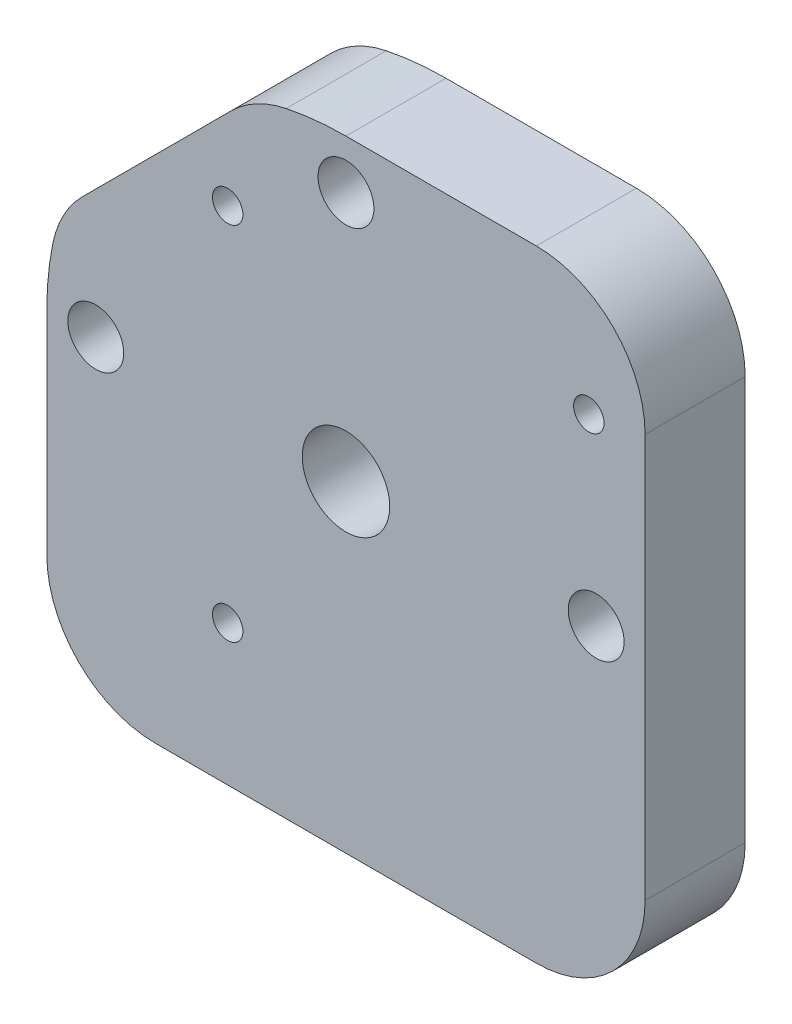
from build123d import *

# Parameters (mm, degrees)
SKETCH1_R               = 17.4625
BOSS_EXTRUDE1_DEPTH     = 5.842
BOSS_EXTRUDE2_DEPTH     = 5.842
FILLET1_R               = 6.35
F_4_CLEARANCE_HOLE1_D   = 3.2639
F_2_56_TAPPED_HOLE1_D   = 1.778
CUT_EXTRUDE2_DEPTH      = 50.8
FILLET2_R               = 6.35
F_1_4_20_TAPPED_HOLE1_D = 5.1054


with BuildPart() as part:
    # Sketch1 → Boss-Extrude1 (new body)
    with BuildSketch(Plane.XY):
        Circle(SKETCH1_R)
    extrude(amount=BOSS_EXTRUDE1_DEPTH)

    # Sketch6 → Boss-Extrude2 (add)
    with BuildSketch(Plane.XY.offset(5.842)):
        Polygon((-17.4625, 0), (0, 0), (0, 17.4625), (17.4625, 17.4625), (17.4625, 0), (17.4625, -18.796), (-17.4625, -18.796), align=None)
    extrude(amount=-BOSS_EXTRUDE2_DEPTH)

    # Fillet1
    fillet1_edges = [part.edges().sort_by_distance(p)[0] for p in [
        (-17.4625, -18.796, 2.921),
        (17.4625, 17.4625, 2.921),
        (17.4625, -18.796, 2.921),
    ]]
    fillet(fillet1_edges, radius=FILLET1_R)

    # 4 Clearance Hole1 (through all)
    with Locations(Plane.XY.offset(5.842)):
        with Locations((-14.605, 0), (14.605, 0), (0, 14.605)):
            Hole(F_4_CLEARANCE_HOLE1_D / 2)

    # 2-56 Tapped Hole1 (through all)
    with Locations(Plane.XY.offset(5.842)):
        with Locations((-6.905174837, 10.482193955), (-6.905174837, -10.599806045), (14.176825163, 10.482193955)):
            Hole(F_2_56_TAPPED_HOLE1_D / 2)

    # Sketch9 → Cut-Extrude2 (cut)
    with BuildSketch(Plane.XY.offset(5.842)):
        Polygon((-19.773472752, 2.314964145), (-1.610764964, 20.477671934), (-19.773472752, 20.477671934), align=None)
    extrude(amount=-CUT_EXTRUDE2_DEPTH, mode=Mode.SUBTRACT)

    # Fillet2
    fillet2_edges = [part.edges().sort_by_distance(p)[0] for p in [
        (-16.566418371, 5.522018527, 2.921),
        (-5.522018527, 16.566418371, 2.921),
    ]]
    fillet(fillet2_edges, radius=FILLET2_R)

    # 1_4-20 Tapped Hole1 (through all)
    with Locations(Plane.XY.offset(5.842)):
        with Locations((0, 0)):
            Hole(F_1_4_20_TAPPED_HOLE1_D / 2)


solid = part.part
